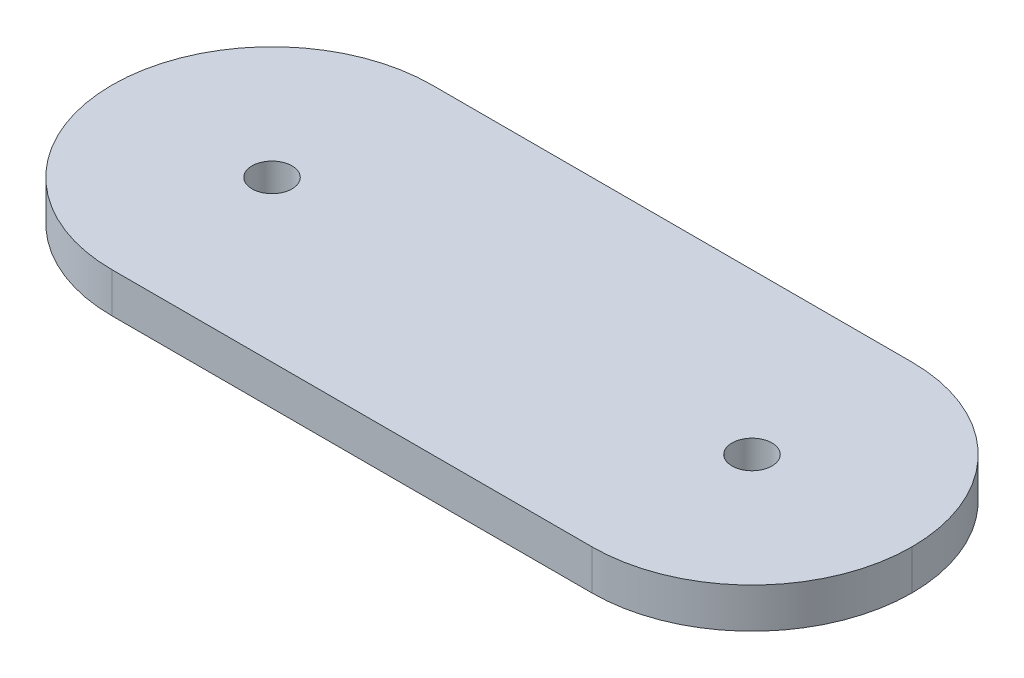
ISO-10303-21;
HEADER;
FILE_DESCRIPTION(('STEP AP214'),'2;1');
FILE_NAME('part.step','',(''),(''),'','','');
FILE_SCHEMA(('AUTOMOTIVE_DESIGN { 1 0 10303 214 1 1 1 1 }'));
ENDSEC;
DATA;
#1=APPLICATION_CONTEXT('core data for automotive mechanical design processes');
#2=APPLICATION_PROTOCOL_DEFINITION('international standard','automotive_design',2000,#1);
#3=PRODUCT_CONTEXT('',#1,'mechanical');
#4=PRODUCT('Part','Part','',(#3));
#5=PRODUCT_RELATED_PRODUCT_CATEGORY('part','',(#4));
#6=PRODUCT_DEFINITION_FORMATION('','',#4);
#7=PRODUCT_DEFINITION_CONTEXT('part definition',#1,'design');
#8=PRODUCT_DEFINITION('design','',#6,#7);
#9=PRODUCT_DEFINITION_SHAPE('','',#8);
#10=(LENGTH_UNIT() NAMED_UNIT(*) SI_UNIT(.MILLI.,.METRE.));
#11=(NAMED_UNIT(*) PLANE_ANGLE_UNIT() SI_UNIT($,.RADIAN.));
#12=(NAMED_UNIT(*) SI_UNIT($,.STERADIAN.) SOLID_ANGLE_UNIT());
#13=UNCERTAINTY_MEASURE_WITH_UNIT(LENGTH_MEASURE(1.E-05),#10,'distance_accuracy_value','');
#14=(GEOMETRIC_REPRESENTATION_CONTEXT(3) GLOBAL_UNCERTAINTY_ASSIGNED_CONTEXT((#13)) GLOBAL_UNIT_ASSIGNED_CONTEXT((#10,
#11,#12)) REPRESENTATION_CONTEXT('',''));
#15=CARTESIAN_POINT('',(0.,0.,0.));
#16=DIRECTION('',(0.,0.,1.));
#17=DIRECTION('',(1.,0.,0.));
#18=AXIS2_PLACEMENT_3D('',#15,#16,#17);
#19=CARTESIAN_POINT('',(0.,3.175,0.));
#20=DIRECTION('',(0.,0.,-1.));
#21=DIRECTION('',(-1.,0.,0.));
#22=AXIS2_PLACEMENT_3D('',#19,#20,#21);
#23=PLANE('',#22);
#24=DIRECTION('',(1.,0.,0.));
#25=VECTOR('',#24,1.);
#26=CARTESIAN_POINT('',(0.,0.,0.));
#27=LINE('',#26,#25);
#28=CARTESIAN_POINT('',(12.7,0.,0.));
#29=VERTEX_POINT('',#28);
#30=CARTESIAN_POINT('',(50.8,0.,0.));
#31=VERTEX_POINT('',#30);
#32=EDGE_CURVE('E100',#29,#31,#27,.T.);
#33=ORIENTED_EDGE('',*,*,#32,.T.);
#34=DIRECTION('',(0.,1.,0.));
#35=VECTOR('',#34,1.);
#36=CARTESIAN_POINT('',(50.8,3.175,0.));
#37=LINE('',#36,#35);
#38=CARTESIAN_POINT('',(50.8,3.175,0.));
#39=VERTEX_POINT('',#38);
#40=EDGE_CURVE('E104',#31,#39,#37,.T.);
#41=ORIENTED_EDGE('',*,*,#40,.T.);
#42=DIRECTION('',(1.,0.,0.));
#43=VECTOR('',#42,1.);
#44=CARTESIAN_POINT('',(0.,3.175,0.));
#45=LINE('',#44,#43);
#46=CARTESIAN_POINT('',(12.7,3.175,0.));
#47=VERTEX_POINT('',#46);
#48=EDGE_CURVE('E103',#47,#39,#45,.T.);
#49=ORIENTED_EDGE('',*,*,#48,.F.);
#50=DIRECTION('',(0.,-1.,0.));
#51=VECTOR('',#50,1.);
#52=CARTESIAN_POINT('',(12.7,3.175,0.));
#53=LINE('',#52,#51);
#54=EDGE_CURVE('E91',#47,#29,#53,.T.);
#55=ORIENTED_EDGE('',*,*,#54,.T.);
#56=EDGE_LOOP('',(#33,#41,#49,#55));
#57=FACE_BOUND('',#56,.T.);
#58=ADVANCED_FACE('F33',(#57),#23,.F.);
#59=CARTESIAN_POINT('',(0.,3.175,-25.4));
#60=DIRECTION('',(0.,0.,1.));
#61=DIRECTION('',(1.,0.,0.));
#62=AXIS2_PLACEMENT_3D('',#59,#60,#61);
#63=PLANE('',#62);
#64=DIRECTION('',(-1.,0.,0.));
#65=VECTOR('',#64,1.);
#66=CARTESIAN_POINT('',(0.,3.175,-25.4));
#67=LINE('',#66,#65);
#68=CARTESIAN_POINT('',(50.8,3.175,-25.4));
#69=VERTEX_POINT('',#68);
#70=CARTESIAN_POINT('',(12.7,3.175,-25.4));
#71=VERTEX_POINT('',#70);
#72=EDGE_CURVE('E105',#69,#71,#67,.T.);
#73=ORIENTED_EDGE('',*,*,#72,.F.);
#74=DIRECTION('',(0.,1.,0.));
#75=VECTOR('',#74,1.);
#76=CARTESIAN_POINT('',(50.8,3.175,-25.4));
#77=LINE('',#76,#75);
#78=CARTESIAN_POINT('',(50.8,0.,-25.4));
#79=VERTEX_POINT('',#78);
#80=EDGE_CURVE('E11',#69,#79,#77,.F.);
#81=ORIENTED_EDGE('',*,*,#80,.T.);
#82=DIRECTION('',(-1.,0.,0.));
#83=VECTOR('',#82,1.);
#84=CARTESIAN_POINT('',(0.,0.,-25.4));
#85=LINE('',#84,#83);
#86=CARTESIAN_POINT('',(12.7,0.,-25.4));
#87=VERTEX_POINT('',#86);
#88=EDGE_CURVE('E111',#79,#87,#85,.T.);
#89=ORIENTED_EDGE('',*,*,#88,.T.);
#90=DIRECTION('',(0.,-1.,0.));
#91=VECTOR('',#90,1.);
#92=CARTESIAN_POINT('',(12.7,3.175,-25.4));
#93=LINE('',#92,#91);
#94=EDGE_CURVE('E42',#87,#71,#93,.F.);
#95=ORIENTED_EDGE('',*,*,#94,.T.);
#96=EDGE_LOOP('',(#73,#81,#89,#95));
#97=FACE_BOUND('',#96,.T.);
#98=ADVANCED_FACE('F153',(#97),#63,.F.);
#99=CARTESIAN_POINT('',(0.,3.175,0.));
#100=DIRECTION('',(0.,-1.,0.));
#101=DIRECTION('',(0.,0.,-1.));
#102=AXIS2_PLACEMENT_3D('',#99,#100,#101);
#103=PLANE('',#102);
#104=CARTESIAN_POINT('',(12.7,3.175,-12.7));
#105=DIRECTION('',(0.,1.,0.));
#106=DIRECTION('',(0.,0.,1.));
#107=AXIS2_PLACEMENT_3D('',#104,#105,#106);
#108=CIRCLE('',#107,1.5875);
#109=CARTESIAN_POINT('',(12.7,3.175,-11.1125));
#110=VERTEX_POINT('',#109);
#111=EDGE_CURVE('E116',#110,#110,#108,.T.);
#112=ORIENTED_EDGE('',*,*,#111,.F.);
#113=EDGE_LOOP('',(#112));
#114=FACE_BOUND('',#113,.T.);
#115=CARTESIAN_POINT('',(50.8,3.175,-12.7));
#116=DIRECTION('',(0.,1.,0.));
#117=DIRECTION('',(0.,0.,1.));
#118=AXIS2_PLACEMENT_3D('',#115,#116,#117);
#119=CIRCLE('',#118,1.5875);
#120=CARTESIAN_POINT('',(50.8,3.175,-11.1125));
#121=VERTEX_POINT('',#120);
#122=EDGE_CURVE('E135',#121,#121,#119,.T.);
#123=ORIENTED_EDGE('',*,*,#122,.F.);
#124=EDGE_LOOP('',(#123));
#125=FACE_BOUND('',#124,.T.);
#126=ORIENTED_EDGE('',*,*,#48,.T.);
#127=CARTESIAN_POINT('',(50.8,3.175,-12.7));
#128=DIRECTION('',(0.,-1.,0.));
#129=DIRECTION('',(0.,0.,-1.));
#130=AXIS2_PLACEMENT_3D('',#127,#128,#129);
#131=CIRCLE('',#130,12.7);
#132=CARTESIAN_POINT('',(63.5,3.175,-12.7));
#133=VERTEX_POINT('',#132);
#134=EDGE_CURVE('E128',#39,#133,#131,.F.);
#135=ORIENTED_EDGE('',*,*,#134,.T.);
#136=CARTESIAN_POINT('',(50.8,3.175,-12.7));
#137=DIRECTION('',(0.,-1.,0.));
#138=DIRECTION('',(0.,0.,-1.));
#139=AXIS2_PLACEMENT_3D('',#136,#137,#138);
#140=CIRCLE('',#139,12.7);
#141=EDGE_CURVE('E126',#133,#69,#140,.F.);
#142=ORIENTED_EDGE('',*,*,#141,.T.);
#143=ORIENTED_EDGE('',*,*,#72,.T.);
#144=CARTESIAN_POINT('',(12.7,3.175,-12.7));
#145=DIRECTION('',(0.,-1.,0.));
#146=DIRECTION('',(0.,0.,-1.));
#147=AXIS2_PLACEMENT_3D('',#144,#145,#146);
#148=CIRCLE('',#147,12.7);
#149=CARTESIAN_POINT('',(0.,3.175,-12.7));
#150=VERTEX_POINT('',#149);
#151=EDGE_CURVE('E122',#71,#150,#148,.F.);
#152=ORIENTED_EDGE('',*,*,#151,.T.);
#153=CARTESIAN_POINT('',(12.7,3.175,-12.7));
#154=DIRECTION('',(0.,-1.,0.));
#155=DIRECTION('',(0.,0.,-1.));
#156=AXIS2_PLACEMENT_3D('',#153,#154,#155);
#157=CIRCLE('',#156,12.7);
#158=EDGE_CURVE('E124',#150,#47,#157,.F.);
#159=ORIENTED_EDGE('',*,*,#158,.T.);
#160=EDGE_LOOP('',(#126,#135,#142,#143,#152,#159));
#161=FACE_BOUND('',#160,.T.);
#162=ADVANCED_FACE('F149',(#114,#125,#161),#103,.F.);
#163=CARTESIAN_POINT('',(0.,0.,0.));
#164=DIRECTION('',(0.,-1.,0.));
#165=DIRECTION('',(0.,0.,-1.));
#166=AXIS2_PLACEMENT_3D('',#163,#164,#165);
#167=PLANE('',#166);
#168=CARTESIAN_POINT('',(50.8,0.,-12.7));
#169=DIRECTION('',(0.,-1.,0.));
#170=DIRECTION('',(0.,0.,-1.));
#171=AXIS2_PLACEMENT_3D('',#168,#169,#170);
#172=CIRCLE('',#171,12.7);
#173=CARTESIAN_POINT('',(63.5,0.,-12.7));
#174=VERTEX_POINT('',#173);
#175=EDGE_CURVE('E94',#79,#174,#172,.T.);
#176=ORIENTED_EDGE('',*,*,#175,.T.);
#177=CARTESIAN_POINT('',(50.8,0.,-12.7));
#178=DIRECTION('',(0.,-1.,0.));
#179=DIRECTION('',(0.,0.,-1.));
#180=AXIS2_PLACEMENT_3D('',#177,#178,#179);
#181=CIRCLE('',#180,12.7);
#182=EDGE_CURVE('E110',#174,#31,#181,.T.);
#183=ORIENTED_EDGE('',*,*,#182,.T.);
#184=ORIENTED_EDGE('',*,*,#32,.F.);
#185=CARTESIAN_POINT('',(12.7,0.,-12.7));
#186=DIRECTION('',(0.,-1.,0.));
#187=DIRECTION('',(0.,0.,-1.));
#188=AXIS2_PLACEMENT_3D('',#185,#186,#187);
#189=CIRCLE('',#188,12.7);
#190=CARTESIAN_POINT('',(0.,0.,-12.7));
#191=VERTEX_POINT('',#190);
#192=EDGE_CURVE('E87',#29,#191,#189,.T.);
#193=ORIENTED_EDGE('',*,*,#192,.T.);
#194=CARTESIAN_POINT('',(12.7,0.,-12.7));
#195=DIRECTION('',(0.,-1.,0.));
#196=DIRECTION('',(0.,0.,-1.));
#197=AXIS2_PLACEMENT_3D('',#194,#195,#196);
#198=CIRCLE('',#197,12.7);
#199=EDGE_CURVE('E50',#191,#87,#198,.T.);
#200=ORIENTED_EDGE('',*,*,#199,.T.);
#201=ORIENTED_EDGE('',*,*,#88,.F.);
#202=EDGE_LOOP('',(#176,#183,#184,#193,#200,#201));
#203=FACE_BOUND('',#202,.T.);
#204=CARTESIAN_POINT('',(12.7,0.,-12.7));
#205=DIRECTION('',(0.,1.,0.));
#206=DIRECTION('',(0.,0.,1.));
#207=AXIS2_PLACEMENT_3D('',#204,#205,#206);
#208=CIRCLE('',#207,1.5875);
#209=CARTESIAN_POINT('',(12.7,0.,-11.1125));
#210=VERTEX_POINT('',#209);
#211=EDGE_CURVE('E112',#210,#210,#208,.T.);
#212=ORIENTED_EDGE('',*,*,#211,.T.);
#213=EDGE_LOOP('',(#212));
#214=FACE_BOUND('',#213,.T.);
#215=CARTESIAN_POINT('',(50.8,0.,-12.7));
#216=DIRECTION('',(0.,1.,0.));
#217=DIRECTION('',(0.,0.,1.));
#218=AXIS2_PLACEMENT_3D('',#215,#216,#217);
#219=CIRCLE('',#218,1.5875);
#220=CARTESIAN_POINT('',(50.8,0.,-11.1125));
#221=VERTEX_POINT('',#220);
#222=EDGE_CURVE('E139',#221,#221,#219,.T.);
#223=ORIENTED_EDGE('',*,*,#222,.T.);
#224=EDGE_LOOP('',(#223));
#225=FACE_BOUND('',#224,.T.);
#226=ADVANCED_FACE('F107',(#203,#214,#225),#167,.T.);
#227=CARTESIAN_POINT('',(50.8,0.,-12.7));
#228=DIRECTION('',(0.,1.,0.));
#229=DIRECTION('',(0.,0.,1.));
#230=AXIS2_PLACEMENT_3D('',#227,#228,#229);
#231=CYLINDRICAL_SURFACE('',#230,1.5875);
#232=ORIENTED_EDGE('',*,*,#222,.F.);
#233=EDGE_LOOP('',(#232));
#234=FACE_BOUND('',#233,.T.);
#235=ORIENTED_EDGE('',*,*,#122,.T.);
#236=EDGE_LOOP('',(#235));
#237=FACE_BOUND('',#236,.T.);
#238=ADVANCED_FACE('F175',(#234,#237),#231,.F.);
#239=CARTESIAN_POINT('',(12.7,0.,-12.7));
#240=DIRECTION('',(0.,1.,0.));
#241=DIRECTION('',(0.,0.,1.));
#242=AXIS2_PLACEMENT_3D('',#239,#240,#241);
#243=CYLINDRICAL_SURFACE('',#242,1.5875);
#244=ORIENTED_EDGE('',*,*,#211,.F.);
#245=EDGE_LOOP('',(#244));
#246=FACE_BOUND('',#245,.T.);
#247=ORIENTED_EDGE('',*,*,#111,.T.);
#248=EDGE_LOOP('',(#247));
#249=FACE_BOUND('',#248,.T.);
#250=ADVANCED_FACE('F164',(#246,#249),#243,.F.);
#251=CARTESIAN_POINT('',(50.8,0.,-12.7));
#252=DIRECTION('',(0.,1.,0.));
#253=DIRECTION('',(0.,0.,1.));
#254=AXIS2_PLACEMENT_3D('',#251,#252,#253);
#255=CYLINDRICAL_SURFACE('',#254,12.7);
#256=DIRECTION('',(0.,1.,0.));
#257=VECTOR('',#256,1.);
#258=CARTESIAN_POINT('',(63.5,0.,-12.7));
#259=LINE('',#258,#257);
#260=EDGE_CURVE('E133',#174,#133,#259,.T.);
#261=ORIENTED_EDGE('',*,*,#260,.F.);
#262=ORIENTED_EDGE('',*,*,#175,.F.);
#263=ORIENTED_EDGE('',*,*,#80,.F.);
#264=ORIENTED_EDGE('',*,*,#141,.F.);
#265=EDGE_LOOP('',(#261,#262,#263,#264));
#266=FACE_BOUND('',#265,.T.);
#267=ADVANCED_FACE('F156',(#266),#255,.T.);
#268=CARTESIAN_POINT('',(50.8,3.175,-12.7));
#269=DIRECTION('',(0.,1.,0.));
#270=DIRECTION('',(0.,0.,1.));
#271=AXIS2_PLACEMENT_3D('',#268,#269,#270);
#272=CYLINDRICAL_SURFACE('',#271,12.7);
#273=ORIENTED_EDGE('',*,*,#182,.F.);
#274=ORIENTED_EDGE('',*,*,#260,.T.);
#275=ORIENTED_EDGE('',*,*,#134,.F.);
#276=ORIENTED_EDGE('',*,*,#40,.F.);
#277=EDGE_LOOP('',(#273,#274,#275,#276));
#278=FACE_BOUND('',#277,.T.);
#279=ADVANCED_FACE('F157',(#278),#272,.T.);
#280=CARTESIAN_POINT('',(12.7,3.175,-12.7));
#281=DIRECTION('',(0.,-1.,0.));
#282=DIRECTION('',(0.,0.,-1.));
#283=AXIS2_PLACEMENT_3D('',#280,#281,#282);
#284=CYLINDRICAL_SURFACE('',#283,12.7);
#285=DIRECTION('',(0.,-1.,0.));
#286=VECTOR('',#285,1.);
#287=CARTESIAN_POINT('',(0.,3.175,-12.7));
#288=LINE('',#287,#286);
#289=EDGE_CURVE('E37',#150,#191,#288,.T.);
#290=ORIENTED_EDGE('',*,*,#289,.F.);
#291=ORIENTED_EDGE('',*,*,#151,.F.);
#292=ORIENTED_EDGE('',*,*,#94,.F.);
#293=ORIENTED_EDGE('',*,*,#199,.F.);
#294=EDGE_LOOP('',(#290,#291,#292,#293));
#295=FACE_BOUND('',#294,.T.);
#296=ADVANCED_FACE('F35',(#295),#284,.T.);
#297=CARTESIAN_POINT('',(12.7,3.175,-12.7));
#298=DIRECTION('',(0.,-1.,0.));
#299=DIRECTION('',(0.,0.,-1.));
#300=AXIS2_PLACEMENT_3D('',#297,#298,#299);
#301=CYLINDRICAL_SURFACE('',#300,12.7);
#302=ORIENTED_EDGE('',*,*,#158,.F.);
#303=ORIENTED_EDGE('',*,*,#289,.T.);
#304=ORIENTED_EDGE('',*,*,#192,.F.);
#305=ORIENTED_EDGE('',*,*,#54,.F.);
#306=EDGE_LOOP('',(#302,#303,#304,#305));
#307=FACE_BOUND('',#306,.T.);
#308=ADVANCED_FACE('F90',(#307),#301,.T.);
#309=CLOSED_SHELL('',(#58,#98,#162,#226,#238,#250,#267,#279,#296,#308));
#310=MANIFOLD_SOLID_BREP('B2',#309);
#311=ADVANCED_BREP_SHAPE_REPRESENTATION('',(#18,#310),#14);
#312=SHAPE_DEFINITION_REPRESENTATION(#9,#311);
ENDSEC;
END-ISO-10303-21;
